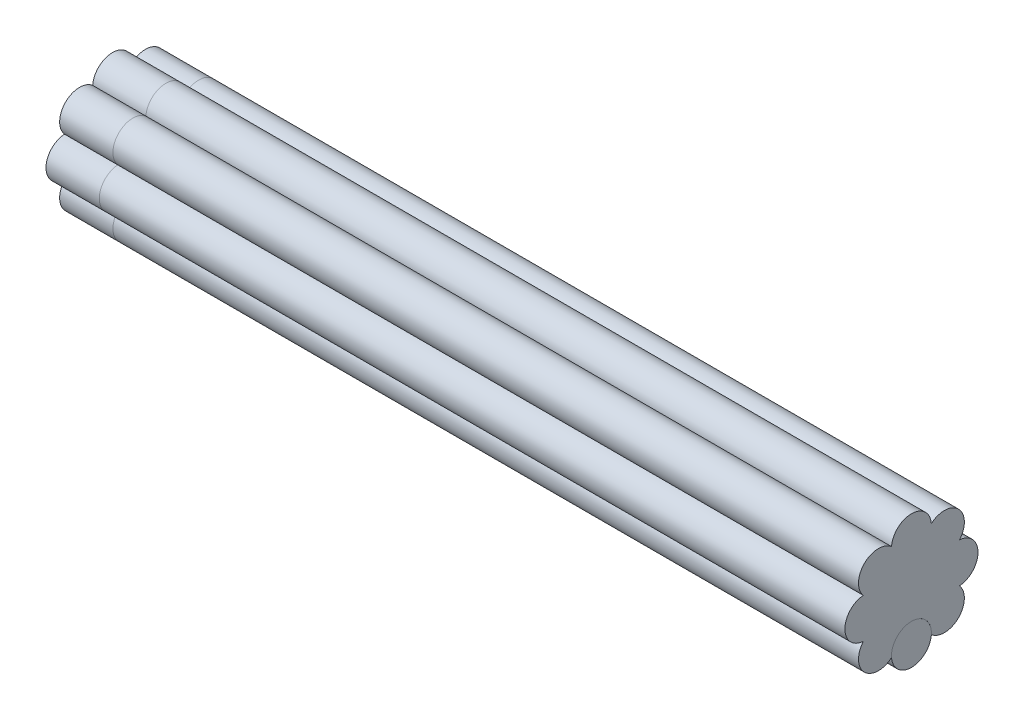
ISO-10303-21;
HEADER;
FILE_DESCRIPTION(('STEP AP214'),'2;1');
FILE_NAME('part.step','',(''),(''),'','','');
FILE_SCHEMA(('AUTOMOTIVE_DESIGN { 1 0 10303 214 1 1 1 1 }'));
ENDSEC;
DATA;
#1=APPLICATION_CONTEXT('core data for automotive mechanical design processes');
#2=APPLICATION_PROTOCOL_DEFINITION('international standard','automotive_design',2000,#1);
#3=PRODUCT_CONTEXT('',#1,'mechanical');
#4=PRODUCT('Part','Part','',(#3));
#5=PRODUCT_RELATED_PRODUCT_CATEGORY('part','',(#4));
#6=PRODUCT_DEFINITION_FORMATION('','',#4);
#7=PRODUCT_DEFINITION_CONTEXT('part definition',#1,'design');
#8=PRODUCT_DEFINITION('design','',#6,#7);
#9=PRODUCT_DEFINITION_SHAPE('','',#8);
#10=(LENGTH_UNIT() NAMED_UNIT(*) SI_UNIT(.MILLI.,.METRE.));
#11=(NAMED_UNIT(*) PLANE_ANGLE_UNIT() SI_UNIT($,.RADIAN.));
#12=(NAMED_UNIT(*) SI_UNIT($,.STERADIAN.) SOLID_ANGLE_UNIT());
#13=UNCERTAINTY_MEASURE_WITH_UNIT(LENGTH_MEASURE(1.E-05),#10,'distance_accuracy_value','');
#14=(GEOMETRIC_REPRESENTATION_CONTEXT(3) GLOBAL_UNCERTAINTY_ASSIGNED_CONTEXT((#13)) GLOBAL_UNIT_ASSIGNED_CONTEXT((#10,
#11,#12)) REPRESENTATION_CONTEXT('',''));
#15=CARTESIAN_POINT('',(0.,0.,0.));
#16=DIRECTION('',(0.,0.,1.));
#17=DIRECTION('',(1.,0.,0.));
#18=AXIS2_PLACEMENT_3D('',#15,#16,#17);
#19=CARTESIAN_POINT('',(-300.,17.5,0.));
#20=DIRECTION('',(1.,0.,0.));
#21=DIRECTION('',(0.,0.,-1.));
#22=AXIS2_PLACEMENT_3D('',#19,#20,#21);
#23=CYLINDRICAL_SURFACE('',#22,7.50000000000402);
#24=CARTESIAN_POINT('',(-280.,17.5,0.));
#25=DIRECTION('',(-1.,0.,0.));
#26=DIRECTION('',(0.,0.,1.));
#27=AXIS2_PLACEMENT_3D('',#24,#25,#26);
#28=CIRCLE('',#27,7.50000000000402);
#29=CARTESIAN_POINT('',(-280.,18.0566599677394,7.47931344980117));
#30=VERTEX_POINT('',#29);
#31=CARTESIAN_POINT('',(-280.,18.0566599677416,-7.47931344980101));
#32=VERTEX_POINT('',#31);
#33=EDGE_CURVE('E140',#30,#32,#28,.T.);
#34=ORIENTED_EDGE('',*,*,#33,.T.);
#35=DIRECTION('',(1.,0.,0.));
#36=VECTOR('',#35,1.);
#37=CARTESIAN_POINT('',(-300.,18.0566599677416,-7.47931344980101));
#38=LINE('',#37,#36);
#39=CARTESIAN_POINT('',(-300.,18.0566599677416,-7.47931344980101));
#40=VERTEX_POINT('',#39);
#41=EDGE_CURVE('E12',#40,#32,#38,.T.);
#42=ORIENTED_EDGE('',*,*,#41,.F.);
#43=CARTESIAN_POINT('',(-300.,17.5,0.));
#44=DIRECTION('',(-1.,0.,0.));
#45=DIRECTION('',(0.,0.,1.));
#46=AXIS2_PLACEMENT_3D('',#43,#44,#45);
#47=CIRCLE('',#46,7.50000000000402);
#48=CARTESIAN_POINT('',(-300.,18.0566599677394,7.47931344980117));
#49=VERTEX_POINT('',#48);
#50=EDGE_CURVE('E154',#49,#40,#47,.T.);
#51=ORIENTED_EDGE('',*,*,#50,.F.);
#52=DIRECTION('',(1.,0.,0.));
#53=VECTOR('',#52,1.);
#54=CARTESIAN_POINT('',(-300.,18.0566599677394,7.47931344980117));
#55=LINE('',#54,#53);
#56=EDGE_CURVE('E136',#49,#30,#55,.T.);
#57=ORIENTED_EDGE('',*,*,#56,.T.);
#58=EDGE_LOOP('',(#34,#42,#51,#57));
#59=FACE_BOUND('',#58,.T.);
#60=ADVANCED_FACE('F44',(#59),#23,.T.);
#61=CARTESIAN_POINT('',(-300.,12.3743686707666,-12.3743686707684));
#62=DIRECTION('',(1.,0.,0.));
#63=DIRECTION('',(0.,0.,-1.));
#64=AXIS2_PLACEMENT_3D('',#61,#62,#63);
#65=CYLINDRICAL_SURFACE('',#64,7.49999999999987);
#66=CARTESIAN_POINT('',(-280.,12.3743686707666,-12.3743686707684));
#67=DIRECTION('',(-1.,0.,0.));
#68=DIRECTION('',(0.,0.,1.));
#69=AXIS2_PLACEMENT_3D('',#66,#67,#68);
#70=CIRCLE('',#69,7.49999999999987);
#71=CARTESIAN_POINT('',(-280.,7.47931344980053,-18.0566599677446));
#72=VERTEX_POINT('',#71);
#73=EDGE_CURVE('E143',#32,#72,#70,.T.);
#74=ORIENTED_EDGE('',*,*,#73,.T.);
#75=DIRECTION('',(1.,0.,0.));
#76=VECTOR('',#75,1.);
#77=CARTESIAN_POINT('',(-300.,7.47931344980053,-18.0566599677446));
#78=LINE('',#77,#76);
#79=CARTESIAN_POINT('',(-300.,7.47931344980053,-18.0566599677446));
#80=VERTEX_POINT('',#79);
#81=EDGE_CURVE('E52',#80,#72,#78,.T.);
#82=ORIENTED_EDGE('',*,*,#81,.F.);
#83=CARTESIAN_POINT('',(-300.,12.3743686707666,-12.3743686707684));
#84=DIRECTION('',(-1.,0.,0.));
#85=DIRECTION('',(0.,0.,1.));
#86=AXIS2_PLACEMENT_3D('',#83,#84,#85);
#87=CIRCLE('',#86,7.49999999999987);
#88=EDGE_CURVE('E103',#40,#80,#87,.T.);
#89=ORIENTED_EDGE('',*,*,#88,.F.);
#90=ORIENTED_EDGE('',*,*,#41,.T.);
#91=EDGE_LOOP('',(#74,#82,#89,#90));
#92=FACE_BOUND('',#91,.T.);
#93=ADVANCED_FACE('F189',(#92),#65,.T.);
#94=CARTESIAN_POINT('',(-300.,3.71525530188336E-12,-17.5000000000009));
#95=DIRECTION('',(1.,0.,0.));
#96=DIRECTION('',(0.,0.,-1.));
#97=AXIS2_PLACEMENT_3D('',#94,#95,#96);
#98=CYLINDRICAL_SURFACE('',#97,7.5);
#99=CARTESIAN_POINT('',(-280.,3.71525530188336E-12,-17.5000000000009));
#100=DIRECTION('',(-1.,0.,0.));
#101=DIRECTION('',(0.,0.,1.));
#102=AXIS2_PLACEMENT_3D('',#99,#100,#101);
#103=CIRCLE('',#102,7.5);
#104=CARTESIAN_POINT('',(-280.,-7.47931344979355,-18.0566599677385));
#105=VERTEX_POINT('',#104);
#106=EDGE_CURVE('E145',#72,#105,#103,.T.);
#107=ORIENTED_EDGE('',*,*,#106,.T.);
#108=DIRECTION('',(1.,0.,0.));
#109=VECTOR('',#108,1.);
#110=CARTESIAN_POINT('',(-300.,-7.47931344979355,-18.0566599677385));
#111=LINE('',#110,#109);
#112=CARTESIAN_POINT('',(-300.,-7.47931344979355,-18.0566599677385));
#113=VERTEX_POINT('',#112);
#114=EDGE_CURVE('E161',#113,#105,#111,.T.);
#115=ORIENTED_EDGE('',*,*,#114,.F.);
#116=CARTESIAN_POINT('',(-300.,3.71525530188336E-12,-17.5000000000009));
#117=DIRECTION('',(-1.,0.,0.));
#118=DIRECTION('',(0.,0.,1.));
#119=AXIS2_PLACEMENT_3D('',#116,#117,#118);
#120=CIRCLE('',#119,7.5);
#121=EDGE_CURVE('E169',#80,#113,#120,.T.);
#122=ORIENTED_EDGE('',*,*,#121,.F.);
#123=ORIENTED_EDGE('',*,*,#81,.T.);
#124=EDGE_LOOP('',(#107,#115,#122,#123));
#125=FACE_BOUND('',#124,.T.);
#126=ADVANCED_FACE('F167',(#125),#98,.T.);
#127=CARTESIAN_POINT('',(-300.,-12.374368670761,-12.3743686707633));
#128=DIRECTION('',(1.,0.,0.));
#129=DIRECTION('',(0.,0.,-1.));
#130=AXIS2_PLACEMENT_3D('',#127,#128,#129);
#131=CYLINDRICAL_SURFACE('',#130,7.50000000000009);
#132=CARTESIAN_POINT('',(-280.,-12.374368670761,-12.3743686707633));
#133=DIRECTION('',(-1.,0.,0.));
#134=DIRECTION('',(0.,0.,1.));
#135=AXIS2_PLACEMENT_3D('',#132,#133,#134);
#136=CIRCLE('',#135,7.50000000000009);
#137=CARTESIAN_POINT('',(-280.,-18.0566599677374,-7.47931344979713));
#138=VERTEX_POINT('',#137);
#139=EDGE_CURVE('E147',#105,#138,#136,.T.);
#140=ORIENTED_EDGE('',*,*,#139,.T.);
#141=DIRECTION('',(1.,0.,0.));
#142=VECTOR('',#141,1.);
#143=CARTESIAN_POINT('',(-300.,-18.0566599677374,-7.47931344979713));
#144=LINE('',#143,#142);
#145=CARTESIAN_POINT('',(-300.,-18.0566599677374,-7.47931344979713));
#146=VERTEX_POINT('',#145);
#147=EDGE_CURVE('E158',#146,#138,#144,.T.);
#148=ORIENTED_EDGE('',*,*,#147,.F.);
#149=CARTESIAN_POINT('',(-300.,-12.374368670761,-12.3743686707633));
#150=DIRECTION('',(-1.,0.,0.));
#151=DIRECTION('',(0.,0.,1.));
#152=AXIS2_PLACEMENT_3D('',#149,#150,#151);
#153=CIRCLE('',#152,7.50000000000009);
#154=EDGE_CURVE('E181',#113,#146,#153,.T.);
#155=ORIENTED_EDGE('',*,*,#154,.F.);
#156=ORIENTED_EDGE('',*,*,#114,.T.);
#157=EDGE_LOOP('',(#140,#148,#155,#156));
#158=FACE_BOUND('',#157,.T.);
#159=ADVANCED_FACE('F177',(#158),#131,.T.);
#160=CARTESIAN_POINT('',(-300.,-17.5,0.));
#161=DIRECTION('',(1.,0.,0.));
#162=DIRECTION('',(0.,0.,-1.));
#163=AXIS2_PLACEMENT_3D('',#160,#161,#162);
#164=CYLINDRICAL_SURFACE('',#163,7.49999999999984);
#165=CARTESIAN_POINT('',(-280.,-17.5,0.));
#166=DIRECTION('',(-1.,0.,0.));
#167=DIRECTION('',(0.,0.,1.));
#168=AXIS2_PLACEMENT_3D('',#165,#166,#167);
#169=CIRCLE('',#168,7.49999999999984);
#170=CARTESIAN_POINT('',(-280.,-18.0566599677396,7.47931344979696));
#171=VERTEX_POINT('',#170);
#172=EDGE_CURVE('E149',#138,#171,#169,.T.);
#173=ORIENTED_EDGE('',*,*,#172,.T.);
#174=DIRECTION('',(1.,0.,0.));
#175=VECTOR('',#174,1.);
#176=CARTESIAN_POINT('',(-300.,-18.0566599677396,7.47931344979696));
#177=LINE('',#176,#175);
#178=CARTESIAN_POINT('',(-300.,-18.0566599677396,7.47931344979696));
#179=VERTEX_POINT('',#178);
#180=EDGE_CURVE('E131',#179,#171,#177,.T.);
#181=ORIENTED_EDGE('',*,*,#180,.F.);
#182=CARTESIAN_POINT('',(-300.,-17.5,0.));
#183=DIRECTION('',(-1.,0.,0.));
#184=DIRECTION('',(0.,0.,1.));
#185=AXIS2_PLACEMENT_3D('',#182,#183,#184);
#186=CIRCLE('',#185,7.49999999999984);
#187=EDGE_CURVE('E122',#146,#179,#186,.T.);
#188=ORIENTED_EDGE('',*,*,#187,.F.);
#189=ORIENTED_EDGE('',*,*,#147,.T.);
#190=EDGE_LOOP('',(#173,#181,#188,#189));
#191=FACE_BOUND('',#190,.T.);
#192=ADVANCED_FACE('F180',(#191),#164,.T.);
#193=CARTESIAN_POINT('',(-300.,-12.3743686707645,12.3743686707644));
#194=DIRECTION('',(1.,0.,0.));
#195=DIRECTION('',(0.,0.,-1.));
#196=AXIS2_PLACEMENT_3D('',#193,#194,#195);
#197=CYLINDRICAL_SURFACE('',#196,7.5);
#198=CARTESIAN_POINT('',(-280.,-12.3743686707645,12.3743686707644));
#199=DIRECTION('',(-1.,0.,0.));
#200=DIRECTION('',(0.,0.,1.));
#201=AXIS2_PLACEMENT_3D('',#198,#199,#200);
#202=CIRCLE('',#201,7.5);
#203=CARTESIAN_POINT('',(-280.,-7.4793134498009,18.0566599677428));
#204=VERTEX_POINT('',#203);
#205=EDGE_CURVE('E130',#171,#204,#202,.T.);
#206=ORIENTED_EDGE('',*,*,#205,.T.);
#207=DIRECTION('',(1.,0.,0.));
#208=VECTOR('',#207,1.);
#209=CARTESIAN_POINT('',(-300.,-7.4793134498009,18.0566599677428));
#210=LINE('',#209,#208);
#211=CARTESIAN_POINT('',(-300.,-7.4793134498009,18.0566599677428));
#212=VERTEX_POINT('',#211);
#213=EDGE_CURVE('E127',#212,#204,#210,.T.);
#214=ORIENTED_EDGE('',*,*,#213,.F.);
#215=CARTESIAN_POINT('',(-300.,-12.3743686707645,12.3743686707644));
#216=DIRECTION('',(-1.,0.,0.));
#217=DIRECTION('',(0.,0.,1.));
#218=AXIS2_PLACEMENT_3D('',#215,#216,#217);
#219=CIRCLE('',#218,7.5);
#220=EDGE_CURVE('E116',#179,#212,#219,.T.);
#221=ORIENTED_EDGE('',*,*,#220,.F.);
#222=ORIENTED_EDGE('',*,*,#180,.T.);
#223=EDGE_LOOP('',(#206,#214,#221,#222));
#224=FACE_BOUND('',#223,.T.);
#225=ADVANCED_FACE('F128',(#224),#197,.T.);
#226=CARTESIAN_POINT('',(-300.,-1.79311426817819E-12,17.5000000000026));
#227=DIRECTION('',(1.,0.,0.));
#228=DIRECTION('',(0.,0.,-1.));
#229=AXIS2_PLACEMENT_3D('',#226,#227,#228);
#230=CYLINDRICAL_SURFACE('',#229,7.50000000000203);
#231=CARTESIAN_POINT('',(-280.,-1.79311426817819E-12,17.5000000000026));
#232=DIRECTION('',(-1.,0.,0.));
#233=DIRECTION('',(0.,0.,1.));
#234=AXIS2_PLACEMENT_3D('',#231,#232,#233);
#235=CIRCLE('',#234,7.50000000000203);
#236=CARTESIAN_POINT('',(-280.,7.47931344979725,18.0566599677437));
#237=VERTEX_POINT('',#236);
#238=EDGE_CURVE('E89',#204,#237,#235,.T.);
#239=ORIENTED_EDGE('',*,*,#238,.T.);
#240=DIRECTION('',(1.,0.,0.));
#241=VECTOR('',#240,1.);
#242=CARTESIAN_POINT('',(-300.,7.47931344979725,18.0566599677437));
#243=LINE('',#242,#241);
#244=CARTESIAN_POINT('',(-300.,7.47931344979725,18.0566599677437));
#245=VERTEX_POINT('',#244);
#246=EDGE_CURVE('E132',#245,#237,#243,.T.);
#247=ORIENTED_EDGE('',*,*,#246,.F.);
#248=CARTESIAN_POINT('',(-300.,-1.79311426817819E-12,17.5000000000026));
#249=DIRECTION('',(-1.,0.,0.));
#250=DIRECTION('',(0.,0.,1.));
#251=AXIS2_PLACEMENT_3D('',#248,#249,#250);
#252=CIRCLE('',#251,7.50000000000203);
#253=EDGE_CURVE('E120',#212,#245,#252,.T.);
#254=ORIENTED_EDGE('',*,*,#253,.F.);
#255=ORIENTED_EDGE('',*,*,#213,.T.);
#256=EDGE_LOOP('',(#239,#247,#254,#255));
#257=FACE_BOUND('',#256,.T.);
#258=ADVANCED_FACE('F134',(#257),#230,.T.);
#259=CARTESIAN_POINT('',(-300.,12.3743686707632,12.3743686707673));
#260=DIRECTION('',(1.,0.,0.));
#261=DIRECTION('',(0.,0.,-1.));
#262=AXIS2_PLACEMENT_3D('',#259,#260,#261);
#263=CYLINDRICAL_SURFACE('',#262,7.5);
#264=CARTESIAN_POINT('',(-280.,12.3743686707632,12.3743686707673));
#265=DIRECTION('',(-1.,0.,0.));
#266=DIRECTION('',(0.,0.,1.));
#267=AXIS2_PLACEMENT_3D('',#264,#265,#266);
#268=CIRCLE('',#267,7.5);
#269=EDGE_CURVE('E95',#237,#30,#268,.T.);
#270=ORIENTED_EDGE('',*,*,#269,.T.);
#271=ORIENTED_EDGE('',*,*,#56,.F.);
#272=CARTESIAN_POINT('',(-300.,12.3743686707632,12.3743686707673));
#273=DIRECTION('',(-1.,0.,0.));
#274=DIRECTION('',(0.,0.,1.));
#275=AXIS2_PLACEMENT_3D('',#272,#273,#274);
#276=CIRCLE('',#275,7.5);
#277=EDGE_CURVE('E60',#245,#49,#276,.T.);
#278=ORIENTED_EDGE('',*,*,#277,.F.);
#279=ORIENTED_EDGE('',*,*,#246,.T.);
#280=EDGE_LOOP('',(#270,#271,#278,#279));
#281=FACE_BOUND('',#280,.T.);
#282=ADVANCED_FACE('F205',(#281),#263,.T.);
#283=CARTESIAN_POINT('',(-300.,14.9371843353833,-6.18718433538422));
#284=DIRECTION('',(-1.,0.,0.));
#285=DIRECTION('',(0.,0.,1.));
#286=AXIS2_PLACEMENT_3D('',#283,#284,#285);
#287=PLANE('',#286);
#288=ORIENTED_EDGE('',*,*,#50,.T.);
#289=ORIENTED_EDGE('',*,*,#88,.T.);
#290=ORIENTED_EDGE('',*,*,#121,.T.);
#291=ORIENTED_EDGE('',*,*,#154,.T.);
#292=ORIENTED_EDGE('',*,*,#187,.T.);
#293=ORIENTED_EDGE('',*,*,#220,.T.);
#294=ORIENTED_EDGE('',*,*,#253,.T.);
#295=ORIENTED_EDGE('',*,*,#277,.T.);
#296=EDGE_LOOP('',(#288,#289,#290,#291,#292,#293,#294,#295));
#297=FACE_BOUND('',#296,.T.);
#298=ADVANCED_FACE('F118',(#297),#287,.T.);
#299=CARTESIAN_POINT('',(-280.,14.9371843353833,-6.18718433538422));
#300=DIRECTION('',(-1.,0.,0.));
#301=DIRECTION('',(0.,0.,1.));
#302=AXIS2_PLACEMENT_3D('',#299,#300,#301);
#303=PLANE('',#302);
#304=ORIENTED_EDGE('',*,*,#33,.F.);
#305=ORIENTED_EDGE('',*,*,#269,.F.);
#306=ORIENTED_EDGE('',*,*,#238,.F.);
#307=ORIENTED_EDGE('',*,*,#205,.F.);
#308=ORIENTED_EDGE('',*,*,#172,.F.);
#309=ORIENTED_EDGE('',*,*,#139,.F.);
#310=ORIENTED_EDGE('',*,*,#106,.F.);
#311=ORIENTED_EDGE('',*,*,#73,.F.);
#312=EDGE_LOOP('',(#304,#305,#306,#307,#308,#309,#310,#311));
#313=FACE_BOUND('',#312,.T.);
#314=ADVANCED_FACE('F173',(#313),#303,.F.);
#315=CLOSED_SHELL('',(#60,#93,#126,#159,#192,#225,#258,#282,#298,#314));
#316=MANIFOLD_SOLID_BREP('B2',#315);
#317=CARTESIAN_POINT('',(-280.,-17.5,0.));
#318=DIRECTION('',(1.,0.,0.));
#319=DIRECTION('',(0.,0.,-1.));
#320=AXIS2_PLACEMENT_3D('',#317,#318,#319);
#321=CYLINDRICAL_SURFACE('',#320,7.5);
#322=CARTESIAN_POINT('',(-280.,-17.5,0.));
#323=DIRECTION('',(1.,0.,0.));
#324=DIRECTION('',(0.,0.,-1.));
#325=AXIS2_PLACEMENT_3D('',#322,#323,#324);
#326=CIRCLE('',#325,7.5);
#327=CARTESIAN_POINT('',(-280.,-17.5,-7.5));
#328=VERTEX_POINT('',#327);
#329=EDGE_CURVE('E43',#328,#328,#326,.T.);
#330=ORIENTED_EDGE('',*,*,#329,.T.);
#331=EDGE_LOOP('',(#330));
#332=FACE_BOUND('',#331,.T.);
#333=CARTESIAN_POINT('',(0.,-17.5,0.));
#334=DIRECTION('',(1.,0.,0.));
#335=DIRECTION('',(0.,0.,-1.));
#336=AXIS2_PLACEMENT_3D('',#333,#334,#335);
#337=CIRCLE('',#336,7.5);
#338=CARTESIAN_POINT('',(0.,-17.5,-7.5));
#339=VERTEX_POINT('',#338);
#340=EDGE_CURVE('E284',#339,#339,#337,.T.);
#341=ORIENTED_EDGE('',*,*,#340,.F.);
#342=EDGE_LOOP('',(#341));
#343=FACE_BOUND('',#342,.T.);
#344=ADVANCED_FACE('F281',(#332,#343),#321,.T.);
#345=CARTESIAN_POINT('',(-280.,-17.5,0.));
#346=DIRECTION('',(1.,0.,0.));
#347=DIRECTION('',(0.,0.,-1.));
#348=AXIS2_PLACEMENT_3D('',#345,#346,#347);
#349=PLANE('',#348);
#350=ORIENTED_EDGE('',*,*,#329,.F.);
#351=EDGE_LOOP('',(#350));
#352=FACE_BOUND('',#351,.T.);
#353=ADVANCED_FACE('F296',(#352),#349,.F.);
#354=CARTESIAN_POINT('',(0.,-17.5,0.));
#355=DIRECTION('',(1.,0.,0.));
#356=DIRECTION('',(0.,0.,-1.));
#357=AXIS2_PLACEMENT_3D('',#354,#355,#356);
#358=PLANE('',#357);
#359=ORIENTED_EDGE('',*,*,#340,.T.);
#360=EDGE_LOOP('',(#359));
#361=FACE_BOUND('',#360,.T.);
#362=ADVANCED_FACE('F293',(#361),#358,.T.);
#363=CLOSED_SHELL('',(#344,#353,#362));
#364=MANIFOLD_SOLID_BREP('B6',#363);
#365=CARTESIAN_POINT('',(-280.,12.3743686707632,12.3743686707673));
#366=DIRECTION('',(1.,0.,0.));
#367=DIRECTION('',(0.,0.,-1.));
#368=AXIS2_PLACEMENT_3D('',#365,#366,#367);
#369=CYLINDRICAL_SURFACE('',#368,7.5);
#370=CARTESIAN_POINT('',(0.,12.3743686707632,12.3743686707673));
#371=DIRECTION('',(1.,0.,0.));
#372=DIRECTION('',(0.,0.,-1.));
#373=AXIS2_PLACEMENT_3D('',#370,#371,#372);
#374=CIRCLE('',#373,7.5);
#375=CARTESIAN_POINT('',(0.,18.0566599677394,7.47931344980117));
#376=VERTEX_POINT('',#375);
#377=CARTESIAN_POINT('',(0.,7.47931344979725,18.0566599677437));
#378=VERTEX_POINT('',#377);
#379=EDGE_CURVE('E419',#376,#378,#374,.T.);
#380=ORIENTED_EDGE('',*,*,#379,.F.);
#381=DIRECTION('',(1.,0.,0.));
#382=VECTOR('',#381,1.);
#383=CARTESIAN_POINT('',(-280.,18.0566599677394,7.47931344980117));
#384=LINE('',#383,#382);
#385=CARTESIAN_POINT('',(-280.,18.0566599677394,7.47931344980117));
#386=VERTEX_POINT('',#385);
#387=EDGE_CURVE('E279',#386,#376,#384,.T.);
#388=ORIENTED_EDGE('',*,*,#387,.F.);
#389=CARTESIAN_POINT('',(-280.,12.3743686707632,12.3743686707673));
#390=DIRECTION('',(1.,0.,0.));
#391=DIRECTION('',(0.,0.,-1.));
#392=AXIS2_PLACEMENT_3D('',#389,#390,#391);
#393=CIRCLE('',#392,7.5);
#394=CARTESIAN_POINT('',(-280.,7.47931344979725,18.0566599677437));
#395=VERTEX_POINT('',#394);
#396=EDGE_CURVE('E439',#386,#395,#393,.T.);
#397=ORIENTED_EDGE('',*,*,#396,.T.);
#398=DIRECTION('',(1.,0.,0.));
#399=VECTOR('',#398,1.);
#400=CARTESIAN_POINT('',(-280.,7.47931344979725,18.0566599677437));
#401=LINE('',#400,#399);
#402=EDGE_CURVE('E325',#395,#378,#401,.T.);
#403=ORIENTED_EDGE('',*,*,#402,.T.);
#404=EDGE_LOOP('',(#380,#388,#397,#403));
#405=FACE_BOUND('',#404,.T.);
#406=ADVANCED_FACE('F322',(#405),#369,.T.);
#407=CARTESIAN_POINT('',(-280.,17.5,0.));
#408=DIRECTION('',(1.,0.,0.));
#409=DIRECTION('',(0.,0.,-1.));
#410=AXIS2_PLACEMENT_3D('',#407,#408,#409);
#411=CYLINDRICAL_SURFACE('',#410,7.50000000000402);
#412=CARTESIAN_POINT('',(0.,17.5,0.));
#413=DIRECTION('',(1.,0.,0.));
#414=DIRECTION('',(0.,0.,-1.));
#415=AXIS2_PLACEMENT_3D('',#412,#413,#414);
#416=CIRCLE('',#415,7.50000000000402);
#417=CARTESIAN_POINT('',(0.,18.0566599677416,-7.47931344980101));
#418=VERTEX_POINT('',#417);
#419=EDGE_CURVE('E437',#418,#376,#416,.T.);
#420=ORIENTED_EDGE('',*,*,#419,.F.);
#421=DIRECTION('',(1.,0.,0.));
#422=VECTOR('',#421,1.);
#423=CARTESIAN_POINT('',(-280.,18.0566599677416,-7.47931344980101));
#424=LINE('',#423,#422);
#425=CARTESIAN_POINT('',(-280.,18.0566599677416,-7.47931344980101));
#426=VERTEX_POINT('',#425);
#427=EDGE_CURVE('E331',#426,#418,#424,.T.);
#428=ORIENTED_EDGE('',*,*,#427,.F.);
#429=CARTESIAN_POINT('',(-280.,17.5,0.));
#430=DIRECTION('',(1.,0.,0.));
#431=DIRECTION('',(0.,0.,-1.));
#432=AXIS2_PLACEMENT_3D('',#429,#430,#431);
#433=CIRCLE('',#432,7.50000000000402);
#434=EDGE_CURVE('E409',#426,#386,#433,.T.);
#435=ORIENTED_EDGE('',*,*,#434,.T.);
#436=ORIENTED_EDGE('',*,*,#387,.T.);
#437=EDGE_LOOP('',(#420,#428,#435,#436));
#438=FACE_BOUND('',#437,.T.);
#439=ADVANCED_FACE('F451',(#438),#411,.T.);
#440=CARTESIAN_POINT('',(-280.,12.3743686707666,-12.3743686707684));
#441=DIRECTION('',(1.,0.,0.));
#442=DIRECTION('',(0.,0.,-1.));
#443=AXIS2_PLACEMENT_3D('',#440,#441,#442);
#444=CYLINDRICAL_SURFACE('',#443,7.49999999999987);
#445=CARTESIAN_POINT('',(0.,12.3743686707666,-12.3743686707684));
#446=DIRECTION('',(1.,0.,0.));
#447=DIRECTION('',(0.,0.,-1.));
#448=AXIS2_PLACEMENT_3D('',#445,#446,#447);
#449=CIRCLE('',#448,7.49999999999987);
#450=CARTESIAN_POINT('',(0.,7.47931344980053,-18.0566599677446));
#451=VERTEX_POINT('',#450);
#452=EDGE_CURVE('E396',#451,#418,#449,.T.);
#453=ORIENTED_EDGE('',*,*,#452,.F.);
#454=DIRECTION('',(1.,0.,0.));
#455=VECTOR('',#454,1.);
#456=CARTESIAN_POINT('',(-280.,7.47931344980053,-18.0566599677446));
#457=LINE('',#456,#455);
#458=CARTESIAN_POINT('',(-280.,7.47931344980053,-18.0566599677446));
#459=VERTEX_POINT('',#458);
#460=EDGE_CURVE('E391',#459,#451,#457,.T.);
#461=ORIENTED_EDGE('',*,*,#460,.F.);
#462=CARTESIAN_POINT('',(-280.,12.3743686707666,-12.3743686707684));
#463=DIRECTION('',(1.,0.,0.));
#464=DIRECTION('',(0.,0.,-1.));
#465=AXIS2_PLACEMENT_3D('',#462,#463,#464);
#466=CIRCLE('',#465,7.49999999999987);
#467=EDGE_CURVE('E394',#459,#426,#466,.T.);
#468=ORIENTED_EDGE('',*,*,#467,.T.);
#469=ORIENTED_EDGE('',*,*,#427,.T.);
#470=EDGE_LOOP('',(#453,#461,#468,#469));
#471=FACE_BOUND('',#470,.T.);
#472=ADVANCED_FACE('F393',(#471),#444,.T.);
#473=CARTESIAN_POINT('',(-280.,3.71525530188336E-12,-17.5000000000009));
#474=DIRECTION('',(1.,0.,0.));
#475=DIRECTION('',(0.,0.,-1.));
#476=AXIS2_PLACEMENT_3D('',#473,#474,#475);
#477=CYLINDRICAL_SURFACE('',#476,7.5);
#478=CARTESIAN_POINT('',(0.,3.71525530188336E-12,-17.5000000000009));
#479=DIRECTION('',(1.,0.,0.));
#480=DIRECTION('',(0.,0.,-1.));
#481=AXIS2_PLACEMENT_3D('',#478,#479,#480);
#482=CIRCLE('',#481,7.5);
#483=CARTESIAN_POINT('',(0.,-7.47931344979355,-18.0566599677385));
#484=VERTEX_POINT('',#483);
#485=EDGE_CURVE('E434',#484,#451,#482,.T.);
#486=ORIENTED_EDGE('',*,*,#485,.F.);
#487=DIRECTION('',(1.,0.,0.));
#488=VECTOR('',#487,1.);
#489=CARTESIAN_POINT('',(-280.,-7.47931344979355,-18.0566599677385));
#490=LINE('',#489,#488);
#491=CARTESIAN_POINT('',(-280.,-7.47931344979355,-18.0566599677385));
#492=VERTEX_POINT('',#491);
#493=EDGE_CURVE('E401',#492,#484,#490,.T.);
#494=ORIENTED_EDGE('',*,*,#493,.F.);
#495=CARTESIAN_POINT('',(-280.,3.71525530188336E-12,-17.5000000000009));
#496=DIRECTION('',(1.,0.,0.));
#497=DIRECTION('',(0.,0.,-1.));
#498=AXIS2_PLACEMENT_3D('',#495,#496,#497);
#499=CIRCLE('',#498,7.5);
#500=EDGE_CURVE('E407',#492,#459,#499,.T.);
#501=ORIENTED_EDGE('',*,*,#500,.T.);
#502=ORIENTED_EDGE('',*,*,#460,.T.);
#503=EDGE_LOOP('',(#486,#494,#501,#502));
#504=FACE_BOUND('',#503,.T.);
#505=ADVANCED_FACE('F411',(#504),#477,.T.);
#506=CARTESIAN_POINT('',(-280.,-12.374368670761,-12.3743686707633));
#507=DIRECTION('',(1.,0.,0.));
#508=DIRECTION('',(0.,0.,-1.));
#509=AXIS2_PLACEMENT_3D('',#506,#507,#508);
#510=CYLINDRICAL_SURFACE('',#509,7.50000000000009);
#511=CARTESIAN_POINT('',(0.,-12.374368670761,-12.3743686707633));
#512=DIRECTION('',(1.,0.,0.));
#513=DIRECTION('',(0.,0.,-1.));
#514=AXIS2_PLACEMENT_3D('',#511,#512,#513);
#515=CIRCLE('',#514,7.50000000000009);
#516=CARTESIAN_POINT('',(0.,-18.0566599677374,-7.47931344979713));
#517=VERTEX_POINT('',#516);
#518=EDGE_CURVE('E431',#517,#484,#515,.T.);
#519=ORIENTED_EDGE('',*,*,#518,.F.);
#520=DIRECTION('',(1.,0.,0.));
#521=VECTOR('',#520,1.);
#522=CARTESIAN_POINT('',(-280.,-18.0566599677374,-7.47931344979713));
#523=LINE('',#522,#521);
#524=CARTESIAN_POINT('',(-280.,-18.0566599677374,-7.47931344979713));
#525=VERTEX_POINT('',#524);
#526=EDGE_CURVE('E443',#525,#517,#523,.T.);
#527=ORIENTED_EDGE('',*,*,#526,.F.);
#528=CARTESIAN_POINT('',(-280.,-12.374368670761,-12.3743686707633));
#529=DIRECTION('',(1.,0.,0.));
#530=DIRECTION('',(0.,0.,-1.));
#531=AXIS2_PLACEMENT_3D('',#528,#529,#530);
#532=CIRCLE('',#531,7.50000000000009);
#533=EDGE_CURVE('E412',#525,#492,#532,.T.);
#534=ORIENTED_EDGE('',*,*,#533,.T.);
#535=ORIENTED_EDGE('',*,*,#493,.T.);
#536=EDGE_LOOP('',(#519,#527,#534,#535));
#537=FACE_BOUND('',#536,.T.);
#538=ADVANCED_FACE('F464',(#537),#510,.T.);
#539=CARTESIAN_POINT('',(-280.,-17.5,0.));
#540=DIRECTION('',(1.,0.,0.));
#541=DIRECTION('',(0.,0.,-1.));
#542=AXIS2_PLACEMENT_3D('',#539,#540,#541);
#543=CYLINDRICAL_SURFACE('',#542,7.49999999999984);
#544=CARTESIAN_POINT('',(0.,-17.5,0.));
#545=DIRECTION('',(-1.,0.,0.));
#546=DIRECTION('',(0.,0.,-1.));
#547=AXIS2_PLACEMENT_3D('',#544,#545,#546);
#548=CIRCLE('',#547,7.49999999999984);
#549=CARTESIAN_POINT('',(0.,-18.0566599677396,7.47931344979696));
#550=VERTEX_POINT('',#549);
#551=EDGE_CURVE('E428',#550,#517,#548,.T.);
#552=ORIENTED_EDGE('',*,*,#551,.F.);
#553=DIRECTION('',(1.,0.,0.));
#554=VECTOR('',#553,1.);
#555=CARTESIAN_POINT('',(-280.,-18.0566599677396,7.47931344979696));
#556=LINE('',#555,#554);
#557=CARTESIAN_POINT('',(-280.,-18.0566599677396,7.47931344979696));
#558=VERTEX_POINT('',#557);
#559=EDGE_CURVE('E445',#558,#550,#556,.T.);
#560=ORIENTED_EDGE('',*,*,#559,.F.);
#561=CARTESIAN_POINT('',(-280.,-17.5,0.));
#562=DIRECTION('',(-1.,0.,0.));
#563=DIRECTION('',(0.,0.,-1.));
#564=AXIS2_PLACEMENT_3D('',#561,#562,#563);
#565=CIRCLE('',#564,7.49999999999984);
#566=EDGE_CURVE('E414',#558,#525,#565,.T.);
#567=ORIENTED_EDGE('',*,*,#566,.T.);
#568=ORIENTED_EDGE('',*,*,#526,.T.);
#569=EDGE_LOOP('',(#552,#560,#567,#568));
#570=FACE_BOUND('',#569,.T.);
#571=ADVANCED_FACE('F467',(#570),#543,.F.);
#572=CARTESIAN_POINT('',(-280.,-12.3743686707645,12.3743686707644));
#573=DIRECTION('',(1.,0.,0.));
#574=DIRECTION('',(0.,0.,-1.));
#575=AXIS2_PLACEMENT_3D('',#572,#573,#574);
#576=CYLINDRICAL_SURFACE('',#575,7.5);
#577=CARTESIAN_POINT('',(0.,-12.3743686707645,12.3743686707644));
#578=DIRECTION('',(1.,0.,0.));
#579=DIRECTION('',(0.,0.,-1.));
#580=AXIS2_PLACEMENT_3D('',#577,#578,#579);
#581=CIRCLE('',#580,7.5);
#582=CARTESIAN_POINT('',(0.,-7.4793134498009,18.0566599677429));
#583=VERTEX_POINT('',#582);
#584=EDGE_CURVE('E425',#583,#550,#581,.T.);
#585=ORIENTED_EDGE('',*,*,#584,.F.);
#586=DIRECTION('',(1.,0.,0.));
#587=VECTOR('',#586,1.);
#588=CARTESIAN_POINT('',(-280.,-7.4793134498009,18.0566599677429));
#589=LINE('',#588,#587);
#590=CARTESIAN_POINT('',(-280.,-7.4793134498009,18.0566599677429));
#591=VERTEX_POINT('',#590);
#592=EDGE_CURVE('E446',#591,#583,#589,.T.);
#593=ORIENTED_EDGE('',*,*,#592,.F.);
#594=CARTESIAN_POINT('',(-280.,-12.3743686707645,12.3743686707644));
#595=DIRECTION('',(1.,0.,0.));
#596=DIRECTION('',(0.,0.,-1.));
#597=AXIS2_PLACEMENT_3D('',#594,#595,#596);
#598=CIRCLE('',#597,7.5);
#599=EDGE_CURVE('E542',#591,#558,#598,.T.);
#600=ORIENTED_EDGE('',*,*,#599,.T.);
#601=ORIENTED_EDGE('',*,*,#559,.T.);
#602=EDGE_LOOP('',(#585,#593,#600,#601));
#603=FACE_BOUND('',#602,.T.);
#604=ADVANCED_FACE('F471',(#603),#576,.T.);
#605=CARTESIAN_POINT('',(-280.,-1.79311426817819E-12,17.5000000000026));
#606=DIRECTION('',(1.,0.,0.));
#607=DIRECTION('',(0.,0.,-1.));
#608=AXIS2_PLACEMENT_3D('',#605,#606,#607);
#609=CYLINDRICAL_SURFACE('',#608,7.50000000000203);
#610=CARTESIAN_POINT('',(0.,-1.79311426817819E-12,17.5000000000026));
#611=DIRECTION('',(1.,0.,0.));
#612=DIRECTION('',(0.,0.,-1.));
#613=AXIS2_PLACEMENT_3D('',#610,#611,#612);
#614=CIRCLE('',#613,7.50000000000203);
#615=EDGE_CURVE('E422',#378,#583,#614,.T.);
#616=ORIENTED_EDGE('',*,*,#615,.F.);
#617=ORIENTED_EDGE('',*,*,#402,.F.);
#618=CARTESIAN_POINT('',(-280.,-1.79311426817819E-12,17.5000000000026));
#619=DIRECTION('',(1.,0.,0.));
#620=DIRECTION('',(0.,0.,-1.));
#621=AXIS2_PLACEMENT_3D('',#618,#619,#620);
#622=CIRCLE('',#621,7.50000000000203);
#623=EDGE_CURVE('E543',#395,#591,#622,.T.);
#624=ORIENTED_EDGE('',*,*,#623,.T.);
#625=ORIENTED_EDGE('',*,*,#592,.T.);
#626=EDGE_LOOP('',(#616,#617,#624,#625));
#627=FACE_BOUND('',#626,.T.);
#628=ADVANCED_FACE('F448',(#627),#609,.T.);
#629=CARTESIAN_POINT('',(-280.,6.18718433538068,14.9371843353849));
#630=DIRECTION('',(1.,0.,0.));
#631=DIRECTION('',(0.,0.,-1.));
#632=AXIS2_PLACEMENT_3D('',#629,#630,#631);
#633=PLANE('',#632);
#634=ORIENTED_EDGE('',*,*,#396,.F.);
#635=ORIENTED_EDGE('',*,*,#434,.F.);
#636=ORIENTED_EDGE('',*,*,#467,.F.);
#637=ORIENTED_EDGE('',*,*,#500,.F.);
#638=ORIENTED_EDGE('',*,*,#533,.F.);
#639=ORIENTED_EDGE('',*,*,#566,.F.);
#640=ORIENTED_EDGE('',*,*,#599,.F.);
#641=ORIENTED_EDGE('',*,*,#623,.F.);
#642=EDGE_LOOP('',(#634,#635,#636,#637,#638,#639,#640,#641));
#643=FACE_BOUND('',#642,.T.);
#644=ADVANCED_FACE('F405',(#643),#633,.F.);
#645=CARTESIAN_POINT('',(0.,6.18718433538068,14.9371843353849));
#646=DIRECTION('',(1.,0.,0.));
#647=DIRECTION('',(0.,0.,-1.));
#648=AXIS2_PLACEMENT_3D('',#645,#646,#647);
#649=PLANE('',#648);
#650=ORIENTED_EDGE('',*,*,#379,.T.);
#651=ORIENTED_EDGE('',*,*,#615,.T.);
#652=ORIENTED_EDGE('',*,*,#584,.T.);
#653=ORIENTED_EDGE('',*,*,#551,.T.);
#654=ORIENTED_EDGE('',*,*,#518,.T.);
#655=ORIENTED_EDGE('',*,*,#485,.T.);
#656=ORIENTED_EDGE('',*,*,#452,.T.);
#657=ORIENTED_EDGE('',*,*,#419,.T.);
#658=EDGE_LOOP('',(#650,#651,#652,#653,#654,#655,#656,#657));
#659=FACE_BOUND('',#658,.T.);
#660=ADVANCED_FACE('F450',(#659),#649,.T.);
#661=CLOSED_SHELL('',(#406,#439,#472,#505,#538,#571,#604,#628,#644,#660));
#662=MANIFOLD_SOLID_BREP('B38',#661);
#663=ADVANCED_BREP_SHAPE_REPRESENTATION('',(#18,#316,#364,#662),#14);
#664=SHAPE_DEFINITION_REPRESENTATION(#9,#663);
ENDSEC;
END-ISO-10303-21;
